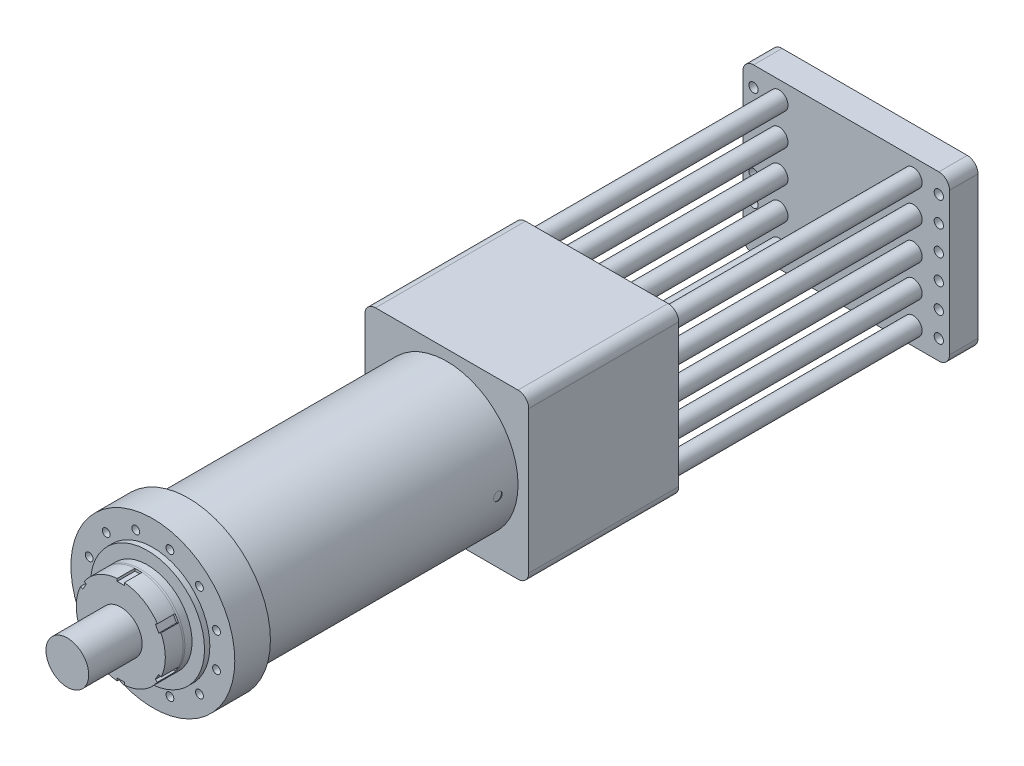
from build123d import *

# Parameters (mm, degrees)
SKETCH_1_R          = 200
EXTRUDE_1_DEPTH     = 725
SKETCH_2_R          = 230
SKETCH_2_R_2        = 11
EXTRUDE_2_DEPTH     = 100
SKETCH_3_R          = 160
EXTRUDE_3_DEPTH     = 15
SKETCH_4_R          = 125
EXTRUDE_4_DEPTH     = 25
CHAMFER_1_SIZE      = 5
CHAMFER_1_SIZE2     = 0.881634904
SKETCH_6_W          = 460
SKETCH_6_H          = 460
EXTRUDE_6_DEPTH     = 421
SKETCH_9_R          = 12
CUT_EXTRUDE_2_DEPTH = 2
SKETCH_10_R         = 12
CUT_EXTRUDE_3_DEPTH = 2
EXTRUDE_7_DEPTH     = 50
SKETCH_11_R         = 60
EXTRUDE_8_DEPTH     = 150
SKETCH_12_R         = 25
EXTRUDE_9_DEPTH     = 700
SKETCH_13_W         = 580
SKETCH_13_H         = 460
SKETCH_13_R         = 13
EXTRUDE_10_DEPTH    = 80
FILLET_1_R          = 30


with BuildPart() as part:
    # Sketch 1 → Extrude 1 (new body)
    with BuildSketch(Plane.XY):
        Circle(SKETCH_1_R)
    extrude(amount=EXTRUDE_1_DEPTH)

    # Sketch 2 → Extrude 2 (add)
    with BuildSketch(Plane.XY.offset(725)):
        Circle(SKETCH_2_R)
        with Locations((178.696277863, 47.881523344)):
            Circle(SKETCH_2_R_2, mode=Mode.SUBTRACT)
        with Locations((178.696277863, -47.881523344)):
            Circle(SKETCH_2_R_2, mode=Mode.SUBTRACT)
        with Locations((130.81475452, -130.81475452)):
            Circle(SKETCH_2_R_2, mode=Mode.SUBTRACT)
        with Locations((47.881523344, -178.696277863)):
            Circle(SKETCH_2_R_2, mode=Mode.SUBTRACT)
        with Locations((-47.881523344, -178.696277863)):
            Circle(SKETCH_2_R_2, mode=Mode.SUBTRACT)
        with Locations((-130.81475452, -130.81475452)):
            Circle(SKETCH_2_R_2, mode=Mode.SUBTRACT)
        with Locations((-178.696277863, -47.881523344)):
            Circle(SKETCH_2_R_2, mode=Mode.SUBTRACT)
        with Locations((-178.696277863, 47.881523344)):
            Circle(SKETCH_2_R_2, mode=Mode.SUBTRACT)
        with Locations((-130.81475452, 130.814754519)):
            Circle(SKETCH_2_R_2, mode=Mode.SUBTRACT)
        with Locations((-47.881523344, 178.696277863)):
            Circle(SKETCH_2_R_2, mode=Mode.SUBTRACT)
        with Locations((47.881523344, 178.696277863)):
            Circle(SKETCH_2_R_2, mode=Mode.SUBTRACT)
        with Locations((130.81475452, 130.81475452)):
            Circle(SKETCH_2_R_2, mode=Mode.SUBTRACT)
    extrude(amount=EXTRUDE_2_DEPTH)

    # Sketch 3 → Extrude 3 (add)
    with BuildSketch(Plane.XY.offset(825)):
        Circle(SKETCH_3_R)
    extrude(amount=EXTRUDE_3_DEPTH)

    # Sketch 4 → Extrude 4 (add)
    with BuildSketch(Plane.XY.offset(840)):
        Circle(SKETCH_4_R)
    extrude(amount=EXTRUDE_4_DEPTH)

    # Chamfer 1
    chamfer_1_edges = [part.edges().sort_by_distance(p)[0] for p in [
        (-125, 0, 865),
    ]]
    chamfer_1_side = [part.faces().sort_by_distance(p)[0] for p in [
        (-125, 0, 852.5),
    ]]
    chamfer(chamfer_1_edges, length=CHAMFER_1_SIZE, length2=CHAMFER_1_SIZE2, reference=chamfer_1_side[0])

    # Sketch 6 → Extrude 6 (add)
    with BuildSketch(Plane(origin=(0, 0, 0), x_dir=(-1, 0, 0), z_dir=(0, 0, -1))):
        Rectangle(SKETCH_6_W, SKETCH_6_H)
    extrude(amount=EXTRUDE_6_DEPTH)

    # Sketch 9 → Cut-Extrude 2 (cut)
    with BuildSketch(Plane(origin=(-200, 0, 0), x_dir=(0, 0, -1), z_dir=(1, 0, 0))):
        with Locations(Location((-36.5, 0, 0), (0, 0, 180))):
            Circle(SKETCH_9_R)
        with Locations(Location((-670.5, 0, 0), (0, 0, 180))):
            Circle(SKETCH_9_R)
    extrude(amount=CUT_EXTRUDE_2_DEPTH, mode=Mode.SUBTRACT)

    # Sketch 10 → Cut-Extrude 3 (cut)
    with BuildSketch(Plane(origin=(200, 0, 0), x_dir=(0, 0, -1), z_dir=(1, 0, 0))):
        with Locations((-56.5, 0)):
            Circle(SKETCH_10_R)
    extrude(amount=-CUT_EXTRUDE_3_DEPTH, mode=Mode.SUBTRACT)

    # Sketch 5 → Extrude 7 (add)
    with BuildSketch(Plane.XY.offset(865)):
        with BuildLine():
            Line((-10, 124.599357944), (-10, 117.5))
            Line((-10, 117.5), (10, 117.5))
            Line((10, 117.5), (10, 124.599357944))
            ThreePointArc((10, 124.599357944), (62.5, 108.253175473), (102.906209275, 70.95993301))
            Line((102.906209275, 70.95993301), (96.757984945, 67.410254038))
            Line((96.757984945, 67.410254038), (106.757984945, 50.089745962))
            Line((106.757984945, 50.089745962), (112.906209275, 53.639424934))
            ThreePointArc((112.906209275, 53.639424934), (125, 0), (112.906209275, -53.639424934))
            Line((112.906209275, -53.639424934), (106.757984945, -50.089745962))
            Line((106.757984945, -50.089745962), (96.757984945, -67.410254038))
            Line((96.757984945, -67.410254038), (102.906209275, -70.95993301))
            ThreePointArc((102.906209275, -70.95993301), (62.5, -108.253175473), (10, -124.599357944))
            Line((10, -124.599357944), (10, -117.5))
            Line((10, -117.5), (-10, -117.5))
            Line((-10, -117.5), (-10, -124.599357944))
            ThreePointArc((-10, -124.599357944), (-62.5, -108.253175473), (-102.906209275, -70.95993301))
            Line((-102.906209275, -70.95993301), (-96.757984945, -67.410254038))
            Line((-96.757984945, -67.410254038), (-106.757984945, -50.089745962))
            Line((-106.757984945, -50.089745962), (-112.906209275, -53.639424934))
            ThreePointArc((-112.906209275, -53.639424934), (-125, 0), (-112.906209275, 53.639424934))
            Line((-112.906209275, 53.639424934), (-106.757984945, 50.089745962))
            Line((-106.757984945, 50.089745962), (-96.757984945, 67.410254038))
            Line((-96.757984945, 67.410254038), (-102.906209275, 70.95993301))
            ThreePointArc((-102.906209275, 70.95993301), (-62.5, 108.253175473), (-10, 124.599357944))
        make_face()
    extrude(amount=EXTRUDE_7_DEPTH)

    # Sketch 11 → Extrude 8 (add)
    with BuildSketch(Plane.XY.offset(915)):
        Circle(SKETCH_11_R)
    extrude(amount=EXTRUDE_8_DEPTH)

    # Sketch 12 → Extrude 9 (add)
    with BuildSketch(Plane(origin=(0, 0, -421), x_dir=(-1, 0, 0), z_dir=(0, 0, -1))):
        with Locations((-188.269799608, 180)):
            Circle(SKETCH_12_R)
        with Locations((-188.269799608, 90)):
            Circle(SKETCH_12_R)
        with Locations((-188.269799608, 0)):
            Circle(SKETCH_12_R)
        with Locations((-188.269799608, -90)):
            Circle(SKETCH_12_R)
        with Locations((-188.269799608, -180)):
            Circle(SKETCH_12_R)
        with Locations(Location((188.269799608, -180, 0), (0, 0, 180))):
            Circle(SKETCH_12_R)
        with Locations(Location((188.269799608, -90, 0), (0, 0, 180))):
            Circle(SKETCH_12_R)
        with Locations(Location((188.269799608, 0, 0), (0, 0, 180))):
            Circle(SKETCH_12_R)
        with Locations(Location((188.269799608, 90, 0), (0, 0, 180))):
            Circle(SKETCH_12_R)
        with Locations(Location((188.269799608, 180, 0), (0, 0, 180))):
            Circle(SKETCH_12_R)
    extrude(amount=EXTRUDE_9_DEPTH)

    # Sketch 13 → Extrude 10 (add)
    with BuildSketch(Plane(origin=(0, 0, -1121), x_dir=(-1, 0, 0), z_dir=(0, 0, -1))):
        Rectangle(SKETCH_13_W, SKETCH_13_H)
        with Locations((-260, 175)):
            Circle(SKETCH_13_R, mode=Mode.SUBTRACT)
        with Locations((-260, 105)):
            Circle(SKETCH_13_R, mode=Mode.SUBTRACT)
        with Locations((-260, -35)):
            Circle(SKETCH_13_R, mode=Mode.SUBTRACT)
        with Locations((-260, -105)):
            Circle(SKETCH_13_R, mode=Mode.SUBTRACT)
        with Locations((-260, -175)):
            Circle(SKETCH_13_R, mode=Mode.SUBTRACT)
        with Locations((-260, 35)):
            Circle(SKETCH_13_R, mode=Mode.SUBTRACT)
        with Locations(Location((260, -175, 0), (0, 0, 180))):
            Circle(SKETCH_13_R, mode=Mode.SUBTRACT)
        with Locations(Location((260, -105, 0), (0, 0, 180))):
            Circle(SKETCH_13_R, mode=Mode.SUBTRACT)
        with Locations(Location((260, -35, 0), (0, 0, 180))):
            Circle(SKETCH_13_R, mode=Mode.SUBTRACT)
        with Locations(Location((260, 35, 0), (0, 0, 180))):
            Circle(SKETCH_13_R, mode=Mode.SUBTRACT)
        with Locations(Location((260, 105, 0), (0, 0, 180))):
            Circle(SKETCH_13_R, mode=Mode.SUBTRACT)
        with Locations(Location((260, 175, 0), (0, 0, 180))):
            Circle(SKETCH_13_R, mode=Mode.SUBTRACT)
    extrude(amount=EXTRUDE_10_DEPTH)

    # Fillet 1
    fillet_1_edges = [part.edges().sort_by_distance(p)[0] for p in [
        (-290, -230, -1161),
        (-290, 230, -1161),
        (290, 230, -1161),
        (290, -230, -1161),
        (-230, -230, -210.5),
        (-230, 230, -210.5),
        (230, 230, -210.5),
        (230, -230, -210.5),
    ]]
    fillet(fillet_1_edges, radius=FILLET_1_R)


solid = part.part
